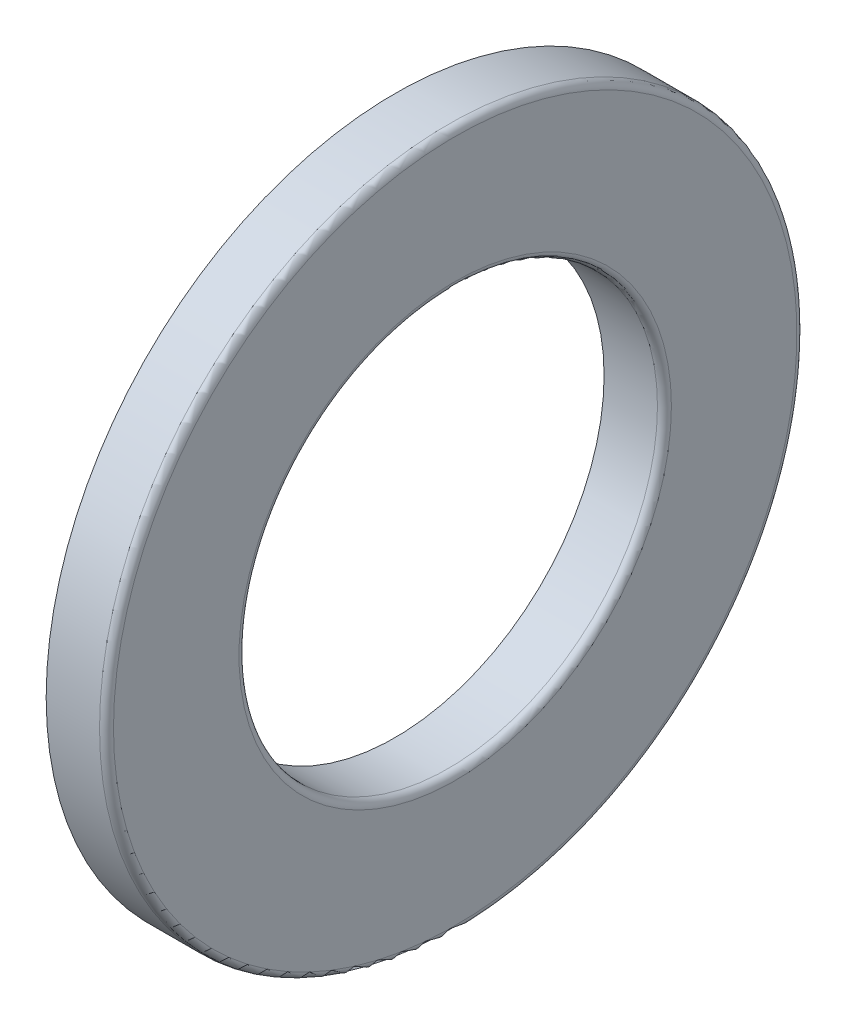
ISO-10303-21;
HEADER;
FILE_DESCRIPTION(('STEP AP214'),'2;1');
FILE_NAME('part.step','',(''),(''),'','','');
FILE_SCHEMA(('AUTOMOTIVE_DESIGN { 1 0 10303 214 1 1 1 1 }'));
ENDSEC;
DATA;
#1=APPLICATION_CONTEXT('core data for automotive mechanical design processes');
#2=APPLICATION_PROTOCOL_DEFINITION('international standard','automotive_design',2000,#1);
#3=PRODUCT_CONTEXT('',#1,'mechanical');
#4=PRODUCT('Part','Part','',(#3));
#5=PRODUCT_RELATED_PRODUCT_CATEGORY('part','',(#4));
#6=PRODUCT_DEFINITION_FORMATION('','',#4);
#7=PRODUCT_DEFINITION_CONTEXT('part definition',#1,'design');
#8=PRODUCT_DEFINITION('design','',#6,#7);
#9=PRODUCT_DEFINITION_SHAPE('','',#8);
#10=(LENGTH_UNIT() NAMED_UNIT(*) SI_UNIT(.MILLI.,.METRE.));
#11=(NAMED_UNIT(*) PLANE_ANGLE_UNIT() SI_UNIT($,.RADIAN.));
#12=(NAMED_UNIT(*) SI_UNIT($,.STERADIAN.) SOLID_ANGLE_UNIT());
#13=UNCERTAINTY_MEASURE_WITH_UNIT(LENGTH_MEASURE(1.E-05),#10,'distance_accuracy_value','');
#14=(GEOMETRIC_REPRESENTATION_CONTEXT(3) GLOBAL_UNCERTAINTY_ASSIGNED_CONTEXT((#13)) GLOBAL_UNIT_ASSIGNED_CONTEXT((#10,
#11,#12)) REPRESENTATION_CONTEXT('',''));
#15=CARTESIAN_POINT('',(0.,0.,0.));
#16=DIRECTION('',(0.,0.,1.));
#17=DIRECTION('',(1.,0.,0.));
#18=AXIS2_PLACEMENT_3D('',#15,#16,#17);
#19=CARTESIAN_POINT('',(6.4048,-15.2786451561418,-15.));
#20=DIRECTION('',(-1.,0.,0.));
#21=DIRECTION('',(0.,0.,1.));
#22=AXIS2_PLACEMENT_3D('',#19,#20,#21);
#23=PLANE('',#22);
#24=CARTESIAN_POINT('',(6.4048,0.,0.));
#25=DIRECTION('',(-1.,0.,0.));
#26=DIRECTION('',(0.,0.,-1.));
#27=AXIS2_PLACEMENT_3D('',#24,#25,#26);
#28=CIRCLE('',#27,15.);
#29=CARTESIAN_POINT('',(6.4048,0.,-15.));
#30=VERTEX_POINT('',#29);
#31=EDGE_CURVE('E44',#30,#30,#28,.F.);
#32=ORIENTED_EDGE('',*,*,#31,.F.);
#33=EDGE_LOOP('',(#32));
#34=FACE_BOUND('',#33,.T.);
#35=CARTESIAN_POINT('',(6.4048,0.,0.));
#36=DIRECTION('',(1.,0.,0.));
#37=DIRECTION('',(0.,0.,1.));
#38=AXIS2_PLACEMENT_3D('',#35,#36,#37);
#39=CIRCLE('',#38,13.1786);
#40=CARTESIAN_POINT('',(6.4048,0.,13.1786));
#41=VERTEX_POINT('',#40);
#42=EDGE_CURVE('E41',#41,#41,#39,.T.);
#43=ORIENTED_EDGE('',*,*,#42,.T.);
#44=EDGE_LOOP('',(#43));
#45=FACE_BOUND('',#44,.T.);
#46=ADVANCED_FACE('F15',(#34,#45),#23,.T.);
#47=CARTESIAN_POINT('',(9.,-14.9730722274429,14.7));
#48=DIRECTION('',(1.,0.,0.));
#49=DIRECTION('',(0.,0.,-1.));
#50=AXIS2_PLACEMENT_3D('',#47,#48,#49);
#51=PLANE('',#50);
#52=CARTESIAN_POINT('',(9.,0.,0.));
#53=DIRECTION('',(1.,0.,0.));
#54=DIRECTION('',(0.,-1.16855773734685E-09,1.));
#55=AXIS2_PLACEMENT_3D('',#52,#53,#54);
#56=CIRCLE('',#55,14.7);
#57=CARTESIAN_POINT('',(9.,-1.71777987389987E-08,14.7));
#58=VERTEX_POINT('',#57);
#59=EDGE_CURVE('E38',#58,#58,#56,.T.);
#60=ORIENTED_EDGE('',*,*,#59,.T.);
#61=EDGE_LOOP('',(#60));
#62=FACE_BOUND('',#61,.T.);
#63=CARTESIAN_POINT('',(9.,0.,0.));
#64=DIRECTION('',(-1.,0.,0.));
#65=DIRECTION('',(0.,0.,-1.));
#66=AXIS2_PLACEMENT_3D('',#63,#64,#65);
#67=CIRCLE('',#66,9.3);
#68=CARTESIAN_POINT('',(9.,0.,-9.3));
#69=VERTEX_POINT('',#68);
#70=EDGE_CURVE('E35',#69,#69,#67,.F.);
#71=ORIENTED_EDGE('',*,*,#70,.F.);
#72=EDGE_LOOP('',(#71));
#73=FACE_BOUND('',#72,.T.);
#74=ADVANCED_FACE('F53',(#62,#73),#51,.T.);
#75=CARTESIAN_POINT('',(6.4048,-10.6034214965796,-10.3214));
#76=DIRECTION('',(-1.,0.,0.));
#77=DIRECTION('',(0.,0.,1.));
#78=AXIS2_PLACEMENT_3D('',#75,#76,#77);
#79=PLANE('',#78);
#80=CARTESIAN_POINT('',(6.4048,0.,0.));
#81=DIRECTION('',(-1.,0.,0.));
#82=DIRECTION('',(0.,0.,-1.));
#83=AXIS2_PLACEMENT_3D('',#80,#81,#82);
#84=CIRCLE('',#83,10.3214);
#85=CARTESIAN_POINT('',(6.4048,0.,-10.3214));
#86=VERTEX_POINT('',#85);
#87=EDGE_CURVE('E30',#86,#86,#84,.F.);
#88=ORIENTED_EDGE('',*,*,#87,.F.);
#89=EDGE_LOOP('',(#88));
#90=FACE_BOUND('',#89,.T.);
#91=CARTESIAN_POINT('',(6.4048,0.,0.));
#92=DIRECTION('',(1.,0.,0.));
#93=DIRECTION('',(0.,0.,1.));
#94=AXIS2_PLACEMENT_3D('',#91,#92,#93);
#95=CIRCLE('',#94,9.);
#96=CARTESIAN_POINT('',(6.4048,0.,9.));
#97=VERTEX_POINT('',#96);
#98=EDGE_CURVE('E26',#97,#97,#95,.T.);
#99=ORIENTED_EDGE('',*,*,#98,.T.);
#100=EDGE_LOOP('',(#99));
#101=FACE_BOUND('',#100,.T.);
#102=ADVANCED_FACE('F60',(#90,#101),#79,.T.);
#103=CARTESIAN_POINT('',(4.5,0.,0.));
#104=DIRECTION('',(1.,0.,0.));
#105=DIRECTION('',(0.,0.,1.));
#106=AXIS2_PLACEMENT_3D('',#103,#104,#105);
#107=TOROIDAL_SURFACE('',#106,11.75,2.381);
#108=ORIENTED_EDGE('',*,*,#42,.F.);
#109=EDGE_LOOP('',(#108));
#110=FACE_BOUND('',#109,.T.);
#111=ORIENTED_EDGE('',*,*,#87,.T.);
#112=EDGE_LOOP('',(#111));
#113=FACE_BOUND('',#112,.T.);
#114=ADVANCED_FACE('F57',(#110,#113),#107,.F.);
#115=CARTESIAN_POINT('',(8.7,0.,0.));
#116=DIRECTION('',(1.,0.,0.));
#117=DIRECTION('',(0.,1.92342708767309E-10,1.));
#118=AXIS2_PLACEMENT_3D('',#115,#116,#117);
#119=CYLINDRICAL_SURFACE('',#118,15.);
#120=ORIENTED_EDGE('',*,*,#31,.T.);
#121=EDGE_LOOP('',(#120));
#122=FACE_BOUND('',#121,.T.);
#123=CARTESIAN_POINT('',(8.7,0.,0.));
#124=DIRECTION('',(-1.,0.,0.));
#125=DIRECTION('',(0.,0.,-1.));
#126=AXIS2_PLACEMENT_3D('',#123,#124,#125);
#127=CIRCLE('',#126,15.);
#128=CARTESIAN_POINT('',(8.7,0.,-15.));
#129=VERTEX_POINT('',#128);
#130=EDGE_CURVE('E22',#129,#129,#127,.F.);
#131=ORIENTED_EDGE('',*,*,#130,.F.);
#132=EDGE_LOOP('',(#131));
#133=FACE_BOUND('',#132,.T.);
#134=ADVANCED_FACE('F48',(#122,#133),#119,.T.);
#135=CARTESIAN_POINT('',(8.70000000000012,0.,0.));
#136=DIRECTION('',(1.,0.,0.));
#137=DIRECTION('',(0.,1.92342708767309E-10,1.));
#138=AXIS2_PLACEMENT_3D('',#135,#136,#137);
#139=TOROIDAL_SURFACE('',#138,14.7000000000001,0.299999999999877);
#140=ORIENTED_EDGE('',*,*,#130,.T.);
#141=EDGE_LOOP('',(#140));
#142=FACE_BOUND('',#141,.T.);
#143=ORIENTED_EDGE('',*,*,#59,.F.);
#144=EDGE_LOOP('',(#143));
#145=FACE_BOUND('',#144,.T.);
#146=ADVANCED_FACE('F75',(#142,#145),#139,.T.);
#147=CARTESIAN_POINT('',(8.70000000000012,0.,0.));
#148=DIRECTION('',(1.,0.,0.));
#149=DIRECTION('',(0.,1.92332494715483E-10,1.));
#150=AXIS2_PLACEMENT_3D('',#147,#148,#149);
#151=TOROIDAL_SURFACE('',#150,9.29999999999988,0.299999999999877);
#152=ORIENTED_EDGE('',*,*,#70,.T.);
#153=EDGE_LOOP('',(#152));
#154=FACE_BOUND('',#153,.T.);
#155=CARTESIAN_POINT('',(8.7,0.,0.));
#156=DIRECTION('',(-1.,0.,0.));
#157=DIRECTION('',(0.,0.,-1.));
#158=AXIS2_PLACEMENT_3D('',#155,#156,#157);
#159=CIRCLE('',#158,9.00000000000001);
#160=CARTESIAN_POINT('',(8.7,0.,-9.00000000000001));
#161=VERTEX_POINT('',#160);
#162=EDGE_CURVE('E10',#161,#161,#159,.F.);
#163=ORIENTED_EDGE('',*,*,#162,.F.);
#164=EDGE_LOOP('',(#163));
#165=FACE_BOUND('',#164,.T.);
#166=ADVANCED_FACE('F70',(#154,#165),#151,.T.);
#167=CARTESIAN_POINT('',(8.7,0.,0.));
#168=DIRECTION('',(1.,0.,0.));
#169=DIRECTION('',(0.,7.69328723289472E-10,1.));
#170=AXIS2_PLACEMENT_3D('',#167,#168,#169);
#171=CYLINDRICAL_SURFACE('',#170,9.);
#172=ORIENTED_EDGE('',*,*,#162,.T.);
#173=EDGE_LOOP('',(#172));
#174=FACE_BOUND('',#173,.T.);
#175=ORIENTED_EDGE('',*,*,#98,.F.);
#176=EDGE_LOOP('',(#175));
#177=FACE_BOUND('',#176,.T.);
#178=ADVANCED_FACE('F17',(#174,#177),#171,.F.);
#179=CLOSED_SHELL('',(#46,#74,#102,#114,#134,#146,#166,#178));
#180=MANIFOLD_SOLID_BREP('B1',#179);
#181=ADVANCED_BREP_SHAPE_REPRESENTATION('',(#18,#180),#14);
#182=SHAPE_DEFINITION_REPRESENTATION(#9,#181);
ENDSEC;
END-ISO-10303-21;
